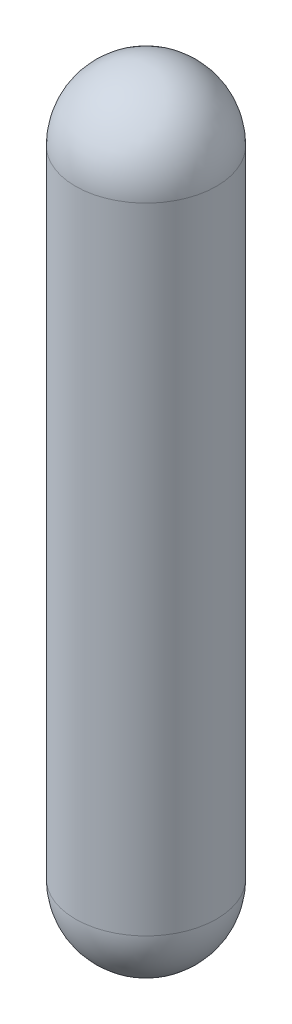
ISO-10303-21;
HEADER;
FILE_DESCRIPTION(('STEP AP214'),'2;1');
FILE_NAME('part.step','',(''),(''),'','','');
FILE_SCHEMA(('AUTOMOTIVE_DESIGN { 1 0 10303 214 1 1 1 1 }'));
ENDSEC;
DATA;
#1=APPLICATION_CONTEXT('core data for automotive mechanical design processes');
#2=APPLICATION_PROTOCOL_DEFINITION('international standard','automotive_design',2000,#1);
#3=PRODUCT_CONTEXT('',#1,'mechanical');
#4=PRODUCT('Part','Part','',(#3));
#5=PRODUCT_RELATED_PRODUCT_CATEGORY('part','',(#4));
#6=PRODUCT_DEFINITION_FORMATION('','',#4);
#7=PRODUCT_DEFINITION_CONTEXT('part definition',#1,'design');
#8=PRODUCT_DEFINITION('design','',#6,#7);
#9=PRODUCT_DEFINITION_SHAPE('','',#8);
#10=(LENGTH_UNIT() NAMED_UNIT(*) SI_UNIT(.MILLI.,.METRE.));
#11=(NAMED_UNIT(*) PLANE_ANGLE_UNIT() SI_UNIT($,.RADIAN.));
#12=(NAMED_UNIT(*) SI_UNIT($,.STERADIAN.) SOLID_ANGLE_UNIT());
#13=UNCERTAINTY_MEASURE_WITH_UNIT(LENGTH_MEASURE(1.E-05),#10,'distance_accuracy_value','');
#14=(GEOMETRIC_REPRESENTATION_CONTEXT(3) GLOBAL_UNCERTAINTY_ASSIGNED_CONTEXT((#13)) GLOBAL_UNIT_ASSIGNED_CONTEXT((#10,
#11,#12)) REPRESENTATION_CONTEXT('',''));
#15=CARTESIAN_POINT('',(0.,0.,0.));
#16=DIRECTION('',(0.,0.,1.));
#17=DIRECTION('',(1.,0.,0.));
#18=AXIS2_PLACEMENT_3D('',#15,#16,#17);
#19=CARTESIAN_POINT('',(0.,-87.5,0.));
#20=DIRECTION('',(0.,1.,0.));
#21=DIRECTION('',(0.,0.,-1.));
#22=AXIS2_PLACEMENT_3D('',#19,#20,#21);
#23=CYLINDRICAL_SURFACE('',#22,2.5);
#24=CARTESIAN_POINT('',(0.,-65.,0.));
#25=DIRECTION('',(0.,-1.,0.));
#26=DIRECTION('',(1.,0.,0.));
#27=AXIS2_PLACEMENT_3D('',#24,#25,#26);
#28=CIRCLE('',#27,2.5);
#29=CARTESIAN_POINT('',(0.,-65.,-2.5));
#30=VERTEX_POINT('',#29);
#31=CARTESIAN_POINT('',(0.,-65.,2.5));
#32=VERTEX_POINT('',#31);
#33=EDGE_CURVE('E11',#30,#32,#28,.T.);
#34=ORIENTED_EDGE('',*,*,#33,.T.);
#35=CARTESIAN_POINT('',(0.,-65.,0.));
#36=DIRECTION('',(0.,1.,0.));
#37=DIRECTION('',(-1.,0.,0.));
#38=AXIS2_PLACEMENT_3D('',#35,#36,#37);
#39=CIRCLE('',#38,2.5);
#40=EDGE_CURVE('E24',#30,#32,#39,.T.);
#41=ORIENTED_EDGE('',*,*,#40,.F.);
#42=EDGE_LOOP('',(#34,#41));
#43=FACE_BOUND('',#42,.T.);
#44=CARTESIAN_POINT('',(0.,-87.5,0.));
#45=DIRECTION('',(0.,-1.,0.));
#46=DIRECTION('',(1.,0.,0.));
#47=AXIS2_PLACEMENT_3D('',#44,#45,#46);
#48=CIRCLE('',#47,2.5);
#49=CARTESIAN_POINT('',(0.,-87.5,-2.5));
#50=VERTEX_POINT('',#49);
#51=CARTESIAN_POINT('',(0.,-87.5,2.5));
#52=VERTEX_POINT('',#51);
#53=EDGE_CURVE('E40',#50,#52,#48,.T.);
#54=ORIENTED_EDGE('',*,*,#53,.F.);
#55=CARTESIAN_POINT('',(0.,-87.5,0.));
#56=DIRECTION('',(0.,1.,0.));
#57=DIRECTION('',(-1.,0.,0.));
#58=AXIS2_PLACEMENT_3D('',#55,#56,#57);
#59=CIRCLE('',#58,2.5);
#60=EDGE_CURVE('E30',#50,#52,#59,.T.);
#61=ORIENTED_EDGE('',*,*,#60,.T.);
#62=EDGE_LOOP('',(#54,#61));
#63=FACE_BOUND('',#62,.T.);
#64=ADVANCED_FACE('F16',(#43,#63),#23,.T.);
#65=CARTESIAN_POINT('',(0.,-65.,0.));
#66=DIRECTION('',(0.,0.,1.));
#67=DIRECTION('',(-1.,0.,0.));
#68=AXIS2_PLACEMENT_3D('',#65,#66,#67);
#69=SPHERICAL_SURFACE('',#68,2.5);
#70=CARTESIAN_POINT('',(0.,-65.,0.));
#71=DIRECTION('',(0.,-1.,0.));
#72=DIRECTION('',(1.,0.,0.));
#73=AXIS2_PLACEMENT_3D('',#70,#71,#72);
#74=SPHERICAL_SURFACE('',#73,2.5);
#75=ORIENTED_EDGE('',*,*,#33,.F.);
#76=ORIENTED_EDGE('',*,*,#40,.T.);
#77=EDGE_LOOP('',(#75,#76));
#78=FACE_BOUND('',#77,.T.);
#79=ADVANCED_FACE('F62',(#78),#74,.T.);
#80=CARTESIAN_POINT('',(0.,-87.5,0.));
#81=DIRECTION('',(0.,0.,1.));
#82=DIRECTION('',(1.,0.,0.));
#83=AXIS2_PLACEMENT_3D('',#80,#81,#82);
#84=SPHERICAL_SURFACE('',#83,2.5);
#85=CARTESIAN_POINT('',(0.,-87.5,0.));
#86=DIRECTION('',(0.,1.,0.));
#87=DIRECTION('',(-1.,0.,0.));
#88=AXIS2_PLACEMENT_3D('',#85,#86,#87);
#89=SPHERICAL_SURFACE('',#88,2.5);
#90=ORIENTED_EDGE('',*,*,#60,.F.);
#91=ORIENTED_EDGE('',*,*,#53,.T.);
#92=EDGE_LOOP('',(#90,#91));
#93=FACE_BOUND('',#92,.T.);
#94=ADVANCED_FACE('F41',(#93),#89,.T.);
#95=CLOSED_SHELL('',(#64,#79,#94));
#96=MANIFOLD_SOLID_BREP('B1',#95);
#97=ADVANCED_BREP_SHAPE_REPRESENTATION('',(#18,#96),#14);
#98=SHAPE_DEFINITION_REPRESENTATION(#9,#97);
ENDSEC;
END-ISO-10303-21;
